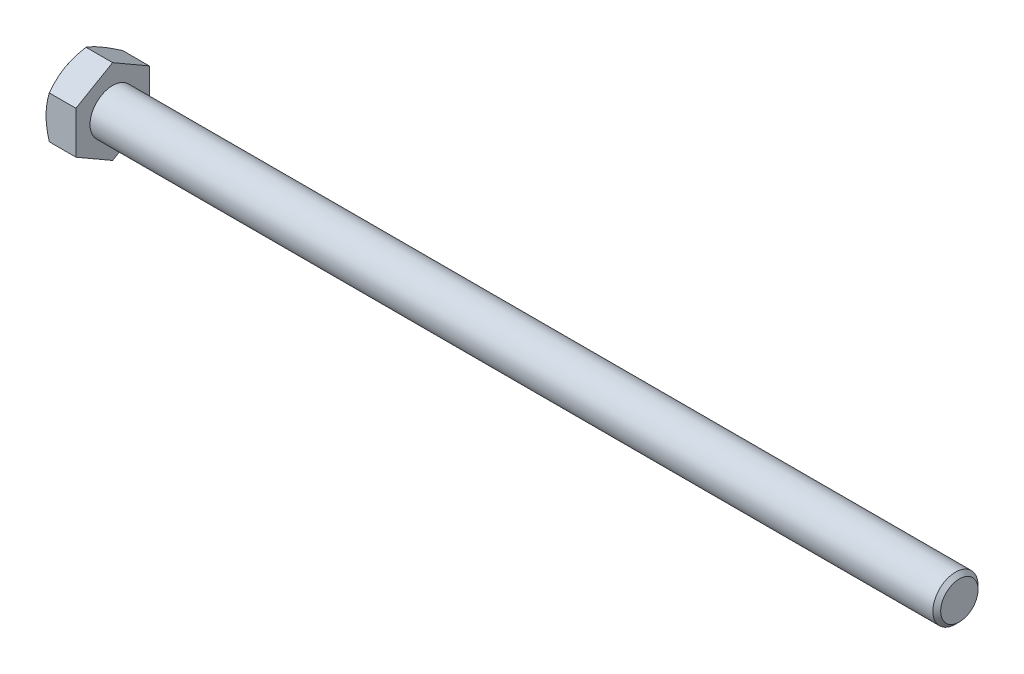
ISO-10303-21;
HEADER;
FILE_DESCRIPTION(('STEP AP214'),'2;1');
FILE_NAME('part.step','',(''),(''),'','','');
FILE_SCHEMA(('AUTOMOTIVE_DESIGN { 1 0 10303 214 1 1 1 1 }'));
ENDSEC;
DATA;
#1=APPLICATION_CONTEXT('core data for automotive mechanical design processes');
#2=APPLICATION_PROTOCOL_DEFINITION('international standard','automotive_design',2000,#1);
#3=PRODUCT_CONTEXT('',#1,'mechanical');
#4=PRODUCT('Part','Part','',(#3));
#5=PRODUCT_RELATED_PRODUCT_CATEGORY('part','',(#4));
#6=PRODUCT_DEFINITION_FORMATION('','',#4);
#7=PRODUCT_DEFINITION_CONTEXT('part definition',#1,'design');
#8=PRODUCT_DEFINITION('design','',#6,#7);
#9=PRODUCT_DEFINITION_SHAPE('','',#8);
#10=(LENGTH_UNIT() NAMED_UNIT(*) SI_UNIT(.MILLI.,.METRE.));
#11=(NAMED_UNIT(*) PLANE_ANGLE_UNIT() SI_UNIT($,.RADIAN.));
#12=(NAMED_UNIT(*) SI_UNIT($,.STERADIAN.) SOLID_ANGLE_UNIT());
#13=UNCERTAINTY_MEASURE_WITH_UNIT(LENGTH_MEASURE(1.E-05),#10,'distance_accuracy_value','');
#14=(GEOMETRIC_REPRESENTATION_CONTEXT(3) GLOBAL_UNCERTAINTY_ASSIGNED_CONTEXT((#13)) GLOBAL_UNIT_ASSIGNED_CONTEXT((#10,
#11,#12)) REPRESENTATION_CONTEXT('',''));
#15=CARTESIAN_POINT('',(0.,0.,0.));
#16=DIRECTION('',(0.,0.,1.));
#17=DIRECTION('',(1.,0.,0.));
#18=AXIS2_PLACEMENT_3D('',#15,#16,#17);
#19=CARTESIAN_POINT('',(5.3,3.75277674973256,-6.5));
#20=DIRECTION('',(0.,-0.866025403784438,0.500000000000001));
#21=DIRECTION('',(0.,-0.500000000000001,-0.866025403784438));
#22=AXIS2_PLACEMENT_3D('',#19,#20,#21);
#23=PLANE('',#22);
#24=CARTESIAN_POINT('',(0.580623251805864,7.50566896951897,0.0002));
#25=CARTESIAN_POINT('',(0.533004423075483,7.4231786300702,-0.14267745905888));
#26=CARTESIAN_POINT('',(0.487546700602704,7.34038072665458,-0.286087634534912));
#27=CARTESIAN_POINT('',(0.401548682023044,7.17411251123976,-0.574072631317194));
#28=CARTESIAN_POINT('',(0.361010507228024,7.09064192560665,-0.718647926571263));
#29=CARTESIAN_POINT('',(0.247571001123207,6.83889369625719,-1.15468865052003));
#30=CARTESIAN_POINT('',(0.183047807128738,6.66962231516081,-1.44787528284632));
#31=CARTESIAN_POINT('',(0.107386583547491,6.41631077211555,-1.88662374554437));
#32=CARTESIAN_POINT('',(0.0858328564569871,6.33302748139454,-2.03087463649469));
#33=CARTESIAN_POINT('',(0.0496903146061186,6.16608458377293,-2.32002821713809));
#34=CARTESIAN_POINT('',(0.0351008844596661,6.08242501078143,-2.46493084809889));
#35=CARTESIAN_POINT('',(0.0132587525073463,5.91496056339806,-2.75498777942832));
#36=CARTESIAN_POINT('',(0.00599772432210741,5.8311559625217,-2.90014160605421));
#37=CARTESIAN_POINT('',(-0.00103969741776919,5.66347396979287,-3.19057533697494));
#38=CARTESIAN_POINT('',(-0.000816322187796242,5.5795965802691,-3.33585523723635));
#39=CARTESIAN_POINT('',(0.0100834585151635,5.34979921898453,-3.73387594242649));
#40=CARTESIAN_POINT('',(0.0283818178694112,5.20395446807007,-3.98648646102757));
#41=CARTESIAN_POINT('',(0.0864063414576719,4.91323365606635,-4.49002967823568));
#42=CARTESIAN_POINT('',(0.126152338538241,4.76835861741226,-4.74096060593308));
#43=CARTESIAN_POINT('',(0.225505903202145,4.47705272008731,-5.24551722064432));
#44=CARTESIAN_POINT('',(0.285534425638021,4.33065861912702,-5.49907924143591));
#45=CARTESIAN_POINT('',(0.421774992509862,4.04005357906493,-6.00242193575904));
#46=CARTESIAN_POINT('',(0.497955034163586,3.89583891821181,-6.25220905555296));
#47=CARTESIAN_POINT('',(0.58062325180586,3.75266127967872,-6.5002));
#48=B_SPLINE_CURVE_WITH_KNOTS('',3,(#24,#25,#26,#27,#28,#29,#30,#31,#32,#33,#34,#35,#36,#37,#38,
#39,#40,#41,#42,#43,#44,#45,#46,#47),.UNSPECIFIED.,.F.,.F.,(4,2,2,2,2,2,2,2,2,2,2,4),(0.,
0.515105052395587,1.03043143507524,2.06322554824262,2.56697389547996,3.07067772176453,
3.57380860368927,4.0769239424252,4.9527935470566,5.82947446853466,6.72559912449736,
7.61996451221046),.UNSPECIFIED.);
#49=CARTESIAN_POINT('',(0.58055658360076,7.50555349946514,0.));
#50=VERTEX_POINT('',#49);
#51=CARTESIAN_POINT('',(0.,5.62916512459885,-3.25000000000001));
#52=VERTEX_POINT('',#51);
#53=EDGE_CURVE('E53',#50,#52,#48,.T.);
#54=ORIENTED_EDGE('',*,*,#53,.F.);
#55=DIRECTION('',(-1.,0.,0.));
#56=VECTOR('',#55,1.);
#57=CARTESIAN_POINT('',(5.3,7.50555349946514,0.));
#58=LINE('',#57,#56);
#59=CARTESIAN_POINT('',(5.3,7.50555349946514,0.));
#60=VERTEX_POINT('',#59);
#61=EDGE_CURVE('E157',#60,#50,#58,.T.);
#62=ORIENTED_EDGE('',*,*,#61,.F.);
#63=DIRECTION('',(0.,0.500000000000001,0.866025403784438));
#64=VECTOR('',#63,1.);
#65=CARTESIAN_POINT('',(5.3,3.75277674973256,-6.5));
#66=LINE('',#65,#64);
#67=CARTESIAN_POINT('',(5.3,3.75277674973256,-6.5));
#68=VERTEX_POINT('',#67);
#69=EDGE_CURVE('E263',#68,#60,#66,.T.);
#70=ORIENTED_EDGE('',*,*,#69,.F.);
#71=DIRECTION('',(-1.,0.,0.));
#72=VECTOR('',#71,1.);
#73=CARTESIAN_POINT('',(5.3,3.75277674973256,-6.5));
#74=LINE('',#73,#72);
#75=CARTESIAN_POINT('',(0.580556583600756,3.75277674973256,-6.5));
#76=VERTEX_POINT('',#75);
#77=EDGE_CURVE('E140',#68,#76,#74,.T.);
#78=ORIENTED_EDGE('',*,*,#77,.T.);
#79=EDGE_CURVE('E133',#52,#76,#48,.T.);
#80=ORIENTED_EDGE('',*,*,#79,.F.);
#81=EDGE_LOOP('',(#54,#62,#70,#78,#80));
#82=FACE_BOUND('',#81,.T.);
#83=ADVANCED_FACE('F36',(#82),#23,.F.);
#84=CARTESIAN_POINT('',(5.3,7.50555349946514,0.));
#85=DIRECTION('',(0.,-0.866025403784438,-0.500000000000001));
#86=DIRECTION('',(0.,0.500000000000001,-0.866025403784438));
#87=AXIS2_PLACEMENT_3D('',#84,#85,#86);
#88=PLANE('',#87);
#89=CARTESIAN_POINT('',(0.580623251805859,3.75266127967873,6.50019999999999));
#90=CARTESIAN_POINT('',(0.533004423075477,3.8351516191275,6.35732254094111));
#91=CARTESIAN_POINT('',(0.487546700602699,3.91794952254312,6.21391236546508));
#92=CARTESIAN_POINT('',(0.401548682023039,4.08421773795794,5.9259273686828));
#93=CARTESIAN_POINT('',(0.361010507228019,4.16768832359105,5.78135207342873));
#94=CARTESIAN_POINT('',(0.247571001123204,4.41943655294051,5.34531134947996));
#95=CARTESIAN_POINT('',(0.183047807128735,4.58870793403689,5.05212471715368));
#96=CARTESIAN_POINT('',(0.107386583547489,4.84201947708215,4.61337625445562));
#97=CARTESIAN_POINT('',(0.0858328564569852,4.92530276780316,4.46912536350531));
#98=CARTESIAN_POINT('',(0.0496903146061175,5.09224566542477,4.17997178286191));
#99=CARTESIAN_POINT('',(0.0351008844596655,5.17590523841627,4.03506915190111));
#100=CARTESIAN_POINT('',(0.0132587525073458,5.34336968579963,3.74501222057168));
#101=CARTESIAN_POINT('',(0.00599772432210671,5.427174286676,3.59985839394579));
#102=CARTESIAN_POINT('',(-0.00103969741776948,5.59485627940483,3.30942466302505));
#103=CARTESIAN_POINT('',(-0.000816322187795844,5.6787336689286,3.16414476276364));
#104=CARTESIAN_POINT('',(0.0100834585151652,5.90853103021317,2.76612405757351));
#105=CARTESIAN_POINT('',(0.028381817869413,6.05437578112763,2.51351353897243));
#106=CARTESIAN_POINT('',(0.0864063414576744,6.34509659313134,2.00997032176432));
#107=CARTESIAN_POINT('',(0.126152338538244,6.48997163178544,1.75903939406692));
#108=CARTESIAN_POINT('',(0.225505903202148,6.78127752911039,1.25448277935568));
#109=CARTESIAN_POINT('',(0.285534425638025,6.92767163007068,1.00092075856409));
#110=CARTESIAN_POINT('',(0.421774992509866,7.21827667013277,0.497578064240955));
#111=CARTESIAN_POINT('',(0.49795503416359,7.36249133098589,0.247790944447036));
#112=CARTESIAN_POINT('',(0.580623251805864,7.50566896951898,-0.000200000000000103));
#113=B_SPLINE_CURVE_WITH_KNOTS('',3,(#89,#90,#91,#92,#93,#94,#95,#96,#97,#98,#99,#100,#101,#102,
#103,#104,#105,#106,#107,#108,#109,#110,#111,#112),.UNSPECIFIED.,.F.,.F.,(4,2,2,2,2,2,2,2,2,2,2,
4),(0.,0.515105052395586,1.03043143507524,2.06322554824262,2.56697389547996,3.07067772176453,
3.57380860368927,4.07692394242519,4.95279354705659,5.82947446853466,6.72559912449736,
7.61996451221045),.UNSPECIFIED.);
#114=CARTESIAN_POINT('',(0.580556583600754,3.75277674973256,6.49999999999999));
#115=VERTEX_POINT('',#114);
#116=CARTESIAN_POINT('',(0.,5.62916512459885,3.25000000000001));
#117=VERTEX_POINT('',#116);
#118=EDGE_CURVE('E60',#115,#117,#113,.T.);
#119=ORIENTED_EDGE('',*,*,#118,.F.);
#120=DIRECTION('',(-1.,0.,0.));
#121=VECTOR('',#120,1.);
#122=CARTESIAN_POINT('',(5.3,3.75277674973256,6.49999999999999));
#123=LINE('',#122,#121);
#124=CARTESIAN_POINT('',(5.3,3.75277674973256,6.49999999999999));
#125=VERTEX_POINT('',#124);
#126=EDGE_CURVE('E154',#125,#115,#123,.T.);
#127=ORIENTED_EDGE('',*,*,#126,.F.);
#128=DIRECTION('',(0.,-0.500000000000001,0.866025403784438));
#129=VECTOR('',#128,1.);
#130=CARTESIAN_POINT('',(5.3,7.50555349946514,0.));
#131=LINE('',#130,#129);
#132=EDGE_CURVE('E261',#60,#125,#131,.T.);
#133=ORIENTED_EDGE('',*,*,#132,.F.);
#134=ORIENTED_EDGE('',*,*,#61,.T.);
#135=EDGE_CURVE('E181',#117,#50,#113,.T.);
#136=ORIENTED_EDGE('',*,*,#135,.F.);
#137=EDGE_LOOP('',(#119,#127,#133,#134,#136));
#138=FACE_BOUND('',#137,.T.);
#139=ADVANCED_FACE('F188',(#138),#88,.F.);
#140=CARTESIAN_POINT('',(5.3,3.75277674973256,6.49999999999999));
#141=DIRECTION('',(0.,0.,-1.));
#142=DIRECTION('',(0.,1.,0.));
#143=AXIS2_PLACEMENT_3D('',#140,#141,#142);
#144=PLANE('',#143);
#145=CARTESIAN_POINT('',(3.18835311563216,-10.1137456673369,6.50000000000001));
#146=CARTESIAN_POINT('',(3.05034773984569,-9.82952666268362,6.50000000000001));
#147=CARTESIAN_POINT('',(2.91365616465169,-9.5446586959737,6.5));
#148=CARTESIAN_POINT('',(2.64363899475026,-8.97327978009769,6.5));
#149=CARTESIAN_POINT('',(2.51031392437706,-8.68676858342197,6.5));
#150=CARTESIAN_POINT('',(2.24710473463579,-8.110298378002,6.5));
#151=CARTESIAN_POINT('',(2.11724300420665,-7.82032911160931,6.5));
#152=CARTESIAN_POINT('',(1.86279082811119,-7.23809540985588,6.5));
#153=CARTESIAN_POINT('',(1.73820013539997,-6.94583108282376,6.5));
#154=CARTESIAN_POINT('',(1.49176685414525,-6.34906440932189,6.5));
#155=CARTESIAN_POINT('',(1.37014257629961,-6.0444714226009,6.5));
#156=CARTESIAN_POINT('',(1.13601865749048,-5.43173420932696,6.5));
#157=CARTESIAN_POINT('',(1.02352003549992,-5.12358959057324,6.5));
#158=CARTESIAN_POINT('',(0.810575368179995,-4.50382569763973,6.5));
#159=CARTESIAN_POINT('',(0.710105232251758,-4.19221478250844,6.5));
#160=CARTESIAN_POINT('',(0.524420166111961,-3.56452019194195,6.5));
#161=CARTESIAN_POINT('',(0.439200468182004,-3.248437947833,6.5));
#162=CARTESIAN_POINT('',(0.288524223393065,-2.61335465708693,6.5));
#163=CARTESIAN_POINT('',(0.222961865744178,-2.29437912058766,6.5));
#164=CARTESIAN_POINT('',(0.115312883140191,-1.65238219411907,6.5));
#165=CARTESIAN_POINT('',(0.0732239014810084,-1.32936121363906,6.5));
#166=CARTESIAN_POINT('',(0.0304887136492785,-0.845231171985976,6.5));
#167=CARTESIAN_POINT('',(0.0196493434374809,-0.684982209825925,6.5));
#168=CARTESIAN_POINT('',(0.00475298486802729,-0.364162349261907,6.5));
#169=CARTESIAN_POINT('',(0.000695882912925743,-0.20359145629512,6.5));
#170=CARTESIAN_POINT('',(-0.000531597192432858,0.117577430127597,6.5));
#171=CARTESIAN_POINT('',(0.00229809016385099,0.278175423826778,6.5));
#172=CARTESIAN_POINT('',(0.0147726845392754,0.599108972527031,6.5));
#173=CARTESIAN_POINT('',(0.0244179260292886,0.759444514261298,6.5));
#174=CARTESIAN_POINT('',(0.055496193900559,1.14369946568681,6.5));
#175=CARTESIAN_POINT('',(0.0801030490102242,1.36736763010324,6.5));
#176=CARTESIAN_POINT('',(0.141246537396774,1.81305591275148,6.5));
#177=CARTESIAN_POINT('',(0.177784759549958,2.035075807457,6.49999999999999));
#178=CARTESIAN_POINT('',(0.303360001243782,2.69839633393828,6.49999999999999));
#179=CARTESIAN_POINT('',(0.408335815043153,3.13672010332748,6.49999999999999));
#180=CARTESIAN_POINT('',(0.590564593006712,3.79232112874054,6.49999999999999));
#181=CARTESIAN_POINT('',(0.656313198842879,4.01299150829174,6.49999999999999));
#182=CARTESIAN_POINT('',(0.794681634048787,4.4521885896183,6.49999999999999));
#183=CARTESIAN_POINT('',(0.867301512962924,4.67071527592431,6.49999999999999));
#184=CARTESIAN_POINT('',(1.01824353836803,5.10569490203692,6.49999999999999));
#185=CARTESIAN_POINT('',(1.09656388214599,5.32214847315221,6.49999999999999));
#186=CARTESIAN_POINT('',(1.25798086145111,5.75325725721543,6.49999999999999));
#187=CARTESIAN_POINT('',(1.34107741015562,5.96791250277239,6.49999999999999));
#188=CARTESIAN_POINT('',(1.56029019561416,6.51888445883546,6.49999999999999));
#189=CARTESIAN_POINT('',(1.69936356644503,6.85402316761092,6.49999999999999));
#190=CARTESIAN_POINT('',(1.98501958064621,7.52109583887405,6.49999999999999));
#191=CARTESIAN_POINT('',(2.13160288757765,7.853029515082,6.49999999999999));
#192=CARTESIAN_POINT('',(2.43059748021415,8.51437865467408,6.49999999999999));
#193=CARTESIAN_POINT('',(2.58301057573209,8.84379329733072,6.49999999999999));
#194=CARTESIAN_POINT('',(2.89234869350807,9.50047798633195,6.49999999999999));
#195=CARTESIAN_POINT('',(3.04927357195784,9.82774810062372,6.49999999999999));
#196=CARTESIAN_POINT('',(3.366920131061,10.4809971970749,6.49999999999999));
#197=CARTESIAN_POINT('',(3.5276467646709,10.8069737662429,6.49999999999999));
#198=CARTESIAN_POINT('',(3.85198555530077,11.4574882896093,6.49999999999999));
#199=CARTESIAN_POINT('',(4.0155977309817,11.7820262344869,6.49999999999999));
#200=CARTESIAN_POINT('',(4.50986184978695,12.753746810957,6.49999999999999));
#201=CARTESIAN_POINT('',(4.8439999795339,13.3991555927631,6.49999999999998));
#202=CARTESIAN_POINT('',(5.48575990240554,14.6239779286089,6.49999999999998));
#203=CARTESIAN_POINT('',(5.79279643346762,15.20369957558,6.49999999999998));
#204=CARTESIAN_POINT('',(6.41069188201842,16.3611382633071,6.49999999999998));
#205=CARTESIAN_POINT('',(6.72155098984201,16.9388552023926,6.49999999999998));
#206=CARTESIAN_POINT('',(7.34519775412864,18.0910273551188,6.49999999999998));
#207=CARTESIAN_POINT('',(7.65797694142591,18.6654871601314,6.49999999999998));
#208=CARTESIAN_POINT('',(8.28574397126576,19.8131486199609,6.49999999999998));
#209=CARTESIAN_POINT('',(8.60073166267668,20.3863503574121,6.49999999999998));
#210=CARTESIAN_POINT('',(8.91652967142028,20.9591024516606,6.49999999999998));
#211=B_SPLINE_CURVE_WITH_KNOTS('',3,(#145,#146,#147,#148,#149,#150,#151,#152,#153,#154,#155,
#156,#157,#158,#159,#160,#161,#162,#163,#164,#165,#166,#167,#168,#169,#170,#171,#172,#173,#174,
#175,#176,#177,#178,#179,#180,#181,#182,#183,#184,#185,#186,#187,#188,#189,#190,#191,#192,#193,
#194,#195,#196,#197,#198,#199,#200,#201,#202,#203,#204,#205,#206,#207,#208,#209,#210),
.UNSPECIFIED.,.F.,.F.,(4,2,2,2,2,2,2,2,2,2,2,2,2,2,2,2,2,2,2,2,2,2,2,2,2,2,2,2,2,2,2,2,4),(0.,
0.947868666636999,1.89588406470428,2.84900320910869,3.80207763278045,4.7858977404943,
5.76982755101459,6.75175256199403,7.73337005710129,8.70960474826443,9.68574140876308,
10.1674651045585,10.6491807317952,11.1309009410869,11.6126447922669,12.2873175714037,
12.9620802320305,14.3123184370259,15.0030310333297,15.6937486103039,16.3842486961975,
17.074736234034,18.1631508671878,19.2516618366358,20.3405135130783,21.4293305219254,
22.519654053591,23.6099846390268,25.7902468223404,27.7582608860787,29.7263733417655,
31.6886408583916,33.6507753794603),.UNSPECIFIED.);
#212=CARTESIAN_POINT('',(0.580556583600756,-3.75277674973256,6.5));
#213=VERTEX_POINT('',#212);
#214=CARTESIAN_POINT('',(0.,0.,6.5));
#215=VERTEX_POINT('',#214);
#216=EDGE_CURVE('E274',#213,#215,#211,.T.);
#217=ORIENTED_EDGE('',*,*,#216,.F.);
#218=DIRECTION('',(-1.,0.,0.));
#219=VECTOR('',#218,1.);
#220=CARTESIAN_POINT('',(5.3,-3.75277674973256,6.5));
#221=LINE('',#220,#219);
#222=CARTESIAN_POINT('',(5.3,-3.75277674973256,6.5));
#223=VERTEX_POINT('',#222);
#224=EDGE_CURVE('E145',#223,#213,#221,.T.);
#225=ORIENTED_EDGE('',*,*,#224,.F.);
#226=DIRECTION('',(0.,-1.,0.));
#227=VECTOR('',#226,1.);
#228=CARTESIAN_POINT('',(5.3,3.75277674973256,6.49999999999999));
#229=LINE('',#228,#227);
#230=EDGE_CURVE('E256',#125,#223,#229,.T.);
#231=ORIENTED_EDGE('',*,*,#230,.F.);
#232=ORIENTED_EDGE('',*,*,#126,.T.);
#233=EDGE_CURVE('E206',#215,#115,#211,.T.);
#234=ORIENTED_EDGE('',*,*,#233,.F.);
#235=EDGE_LOOP('',(#217,#225,#231,#232,#234));
#236=FACE_BOUND('',#235,.T.);
#237=ADVANCED_FACE('F282',(#236),#144,.F.);
#238=CARTESIAN_POINT('',(5.3,-7.50555349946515,0.));
#239=DIRECTION('',(0.,0.866025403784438,-0.500000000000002));
#240=DIRECTION('',(0.,0.500000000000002,0.866025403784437));
#241=AXIS2_PLACEMENT_3D('',#238,#239,#240);
#242=PLANE('',#241);
#243=CARTESIAN_POINT('',(0.58062325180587,-7.50566896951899,-0.000200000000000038));
#244=CARTESIAN_POINT('',(0.533004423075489,-7.42317863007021,0.14267745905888));
#245=CARTESIAN_POINT('',(0.487546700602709,-7.34038072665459,0.286087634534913));
#246=CARTESIAN_POINT('',(0.401548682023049,-7.17411251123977,0.574072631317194));
#247=CARTESIAN_POINT('',(0.361010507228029,-7.09064192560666,0.718647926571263));
#248=CARTESIAN_POINT('',(0.247571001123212,-6.8388936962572,1.15468865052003));
#249=CARTESIAN_POINT('',(0.183047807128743,-6.66962231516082,1.44787528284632));
#250=CARTESIAN_POINT('',(0.107386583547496,-6.41631077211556,1.88662374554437));
#251=CARTESIAN_POINT('',(0.0858328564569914,-6.33302748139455,2.03087463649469));
#252=CARTESIAN_POINT('',(0.0496903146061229,-6.16608458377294,2.32002821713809));
#253=CARTESIAN_POINT('',(0.0351008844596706,-6.08242501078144,2.46493084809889));
#254=CARTESIAN_POINT('',(0.0132587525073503,-5.91496056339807,2.75498777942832));
#255=CARTESIAN_POINT('',(0.00599772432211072,-5.83115596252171,2.90014160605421));
#256=CARTESIAN_POINT('',(-0.00103969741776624,-5.66347396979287,3.19057533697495));
#257=CARTESIAN_POINT('',(-0.000816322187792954,-5.57959658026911,3.33585523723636));
#258=CARTESIAN_POINT('',(0.0100834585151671,-5.34979921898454,3.73387594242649));
#259=CARTESIAN_POINT('',(0.028381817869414,-5.20395446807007,3.98648646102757));
#260=CARTESIAN_POINT('',(0.0864063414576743,-4.91323365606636,4.49002967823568));
#261=CARTESIAN_POINT('',(0.126152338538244,-4.76835861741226,4.74096060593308));
#262=CARTESIAN_POINT('',(0.225505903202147,-4.47705272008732,5.24551722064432));
#263=CARTESIAN_POINT('',(0.285534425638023,-4.33065861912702,5.49907924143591));
#264=CARTESIAN_POINT('',(0.421774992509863,-4.04005357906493,6.00242193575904));
#265=CARTESIAN_POINT('',(0.497955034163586,-3.89583891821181,6.25220905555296));
#266=CARTESIAN_POINT('',(0.58062325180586,-3.75266127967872,6.5002));
#267=B_SPLINE_CURVE_WITH_KNOTS('',3,(#243,#244,#245,#246,#247,#248,#249,#250,#251,#252,#253,
#254,#255,#256,#257,#258,#259,#260,#261,#262,#263,#264,#265,#266),.UNSPECIFIED.,.F.,.F.,(4,2,2,
2,2,2,2,2,2,2,2,4),(0.,0.515105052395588,1.03043143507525,2.06322554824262,2.56697389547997,
3.07067772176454,3.57380860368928,4.0769239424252,4.9527935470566,5.82947446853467,
6.72559912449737,7.61996451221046),.UNSPECIFIED.);
#268=CARTESIAN_POINT('',(0.580556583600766,-7.50555349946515,0.));
#269=VERTEX_POINT('',#268);
#270=CARTESIAN_POINT('',(0.,-5.62916512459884,3.25000000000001));
#271=VERTEX_POINT('',#270);
#272=EDGE_CURVE('E190',#269,#271,#267,.T.);
#273=ORIENTED_EDGE('',*,*,#272,.F.);
#274=DIRECTION('',(-1.,0.,0.));
#275=VECTOR('',#274,1.);
#276=CARTESIAN_POINT('',(5.3,-7.50555349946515,0.));
#277=LINE('',#276,#275);
#278=CARTESIAN_POINT('',(5.3,-7.50555349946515,0.));
#279=VERTEX_POINT('',#278);
#280=EDGE_CURVE('E139',#279,#269,#277,.T.);
#281=ORIENTED_EDGE('',*,*,#280,.F.);
#282=DIRECTION('',(0.,-0.500000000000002,-0.866025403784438));
#283=VECTOR('',#282,1.);
#284=CARTESIAN_POINT('',(5.3,-7.50555349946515,0.));
#285=LINE('',#284,#283);
#286=EDGE_CURVE('E253',#223,#279,#285,.T.);
#287=ORIENTED_EDGE('',*,*,#286,.F.);
#288=ORIENTED_EDGE('',*,*,#224,.T.);
#289=EDGE_CURVE('E193',#271,#213,#267,.T.);
#290=ORIENTED_EDGE('',*,*,#289,.F.);
#291=EDGE_LOOP('',(#273,#281,#287,#288,#290));
#292=FACE_BOUND('',#291,.T.);
#293=ADVANCED_FACE('F248',(#292),#242,.F.);
#294=CARTESIAN_POINT('',(5.3,-3.75277674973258,-6.5));
#295=DIRECTION('',(0.,0.866025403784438,0.5));
#296=DIRECTION('',(0.,-0.5,0.866025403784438));
#297=AXIS2_PLACEMENT_3D('',#294,#295,#296);
#298=PLANE('',#297);
#299=CARTESIAN_POINT('',(0.580623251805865,-3.75266127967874,-6.5002));
#300=CARTESIAN_POINT('',(0.533004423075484,-3.83515161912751,-6.35732254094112));
#301=CARTESIAN_POINT('',(0.487546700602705,-3.91794952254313,-6.21391236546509));
#302=CARTESIAN_POINT('',(0.401548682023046,-4.08421773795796,-5.9259273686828));
#303=CARTESIAN_POINT('',(0.361010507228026,-4.16768832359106,-5.78135207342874));
#304=CARTESIAN_POINT('',(0.24757100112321,-4.41943655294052,-5.34531134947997));
#305=CARTESIAN_POINT('',(0.183047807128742,-4.58870793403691,-5.05212471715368));
#306=CARTESIAN_POINT('',(0.107386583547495,-4.84201947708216,-4.61337625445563));
#307=CARTESIAN_POINT('',(0.0858328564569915,-4.92530276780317,-4.46912536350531));
#308=CARTESIAN_POINT('',(0.0496903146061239,-5.09224566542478,-4.17997178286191));
#309=CARTESIAN_POINT('',(0.0351008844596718,-5.17590523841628,-4.03506915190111));
#310=CARTESIAN_POINT('',(0.0132587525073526,-5.34336968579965,-3.74501222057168));
#311=CARTESIAN_POINT('',(0.00599772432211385,-5.42717428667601,-3.59985839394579));
#312=CARTESIAN_POINT('',(-0.00103969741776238,-5.59485627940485,-3.30942466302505));
#313=CARTESIAN_POINT('',(-0.000816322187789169,-5.67873366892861,-3.16414476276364));
#314=CARTESIAN_POINT('',(0.0100834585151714,-5.90853103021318,-2.76612405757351));
#315=CARTESIAN_POINT('',(0.0283818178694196,-6.05437578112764,-2.51351353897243));
#316=CARTESIAN_POINT('',(0.0864063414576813,-6.34509659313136,-2.00997032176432));
#317=CARTESIAN_POINT('',(0.126152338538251,-6.48997163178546,-1.75903939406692));
#318=CARTESIAN_POINT('',(0.225505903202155,-6.7812775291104,-1.25448277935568));
#319=CARTESIAN_POINT('',(0.285534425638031,-6.92767163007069,-1.00092075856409));
#320=CARTESIAN_POINT('',(0.421774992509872,-7.21827667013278,-0.497578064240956));
#321=CARTESIAN_POINT('',(0.497955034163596,-7.3624913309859,-0.247790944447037));
#322=CARTESIAN_POINT('',(0.58062325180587,-7.50566896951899,0.000199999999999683));
#323=B_SPLINE_CURVE_WITH_KNOTS('',3,(#299,#300,#301,#302,#303,#304,#305,#306,#307,#308,#309,
#310,#311,#312,#313,#314,#315,#316,#317,#318,#319,#320,#321,#322),.UNSPECIFIED.,.F.,.F.,(4,2,2,
2,2,2,2,2,2,2,2,4),(0.,0.515105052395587,1.03043143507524,2.06322554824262,2.56697389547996,
3.07067772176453,3.57380860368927,4.0769239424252,4.9527935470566,5.82947446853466,
6.72559912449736,7.61996451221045),.UNSPECIFIED.);
#324=CARTESIAN_POINT('',(0.580556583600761,-3.75277674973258,-6.5));
#325=VERTEX_POINT('',#324);
#326=CARTESIAN_POINT('',(0.,-5.62916512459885,-3.25));
#327=VERTEX_POINT('',#326);
#328=EDGE_CURVE('E113',#325,#327,#323,.T.);
#329=ORIENTED_EDGE('',*,*,#328,.F.);
#330=DIRECTION('',(-1.,0.,0.));
#331=VECTOR('',#330,1.);
#332=CARTESIAN_POINT('',(5.3,-3.75277674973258,-6.5));
#333=LINE('',#332,#331);
#334=CARTESIAN_POINT('',(5.3,-3.75277674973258,-6.5));
#335=VERTEX_POINT('',#334);
#336=EDGE_CURVE('E128',#335,#325,#333,.T.);
#337=ORIENTED_EDGE('',*,*,#336,.F.);
#338=DIRECTION('',(0.,0.5,-0.866025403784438));
#339=VECTOR('',#338,1.);
#340=CARTESIAN_POINT('',(5.3,-3.75277674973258,-6.5));
#341=LINE('',#340,#339);
#342=EDGE_CURVE('E250',#279,#335,#341,.T.);
#343=ORIENTED_EDGE('',*,*,#342,.F.);
#344=ORIENTED_EDGE('',*,*,#280,.T.);
#345=EDGE_CURVE('E131',#327,#269,#323,.T.);
#346=ORIENTED_EDGE('',*,*,#345,.F.);
#347=EDGE_LOOP('',(#329,#337,#343,#344,#346));
#348=FACE_BOUND('',#347,.T.);
#349=ADVANCED_FACE('F126',(#348),#298,.F.);
#350=CARTESIAN_POINT('',(5.3,3.75277674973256,-6.5));
#351=DIRECTION('',(0.,0.,1.));
#352=DIRECTION('',(0.,-1.,0.));
#353=AXIS2_PLACEMENT_3D('',#350,#351,#352);
#354=PLANE('',#353);
#355=CARTESIAN_POINT('',(3.18835311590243,-10.1137456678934,-6.5));
#356=CARTESIAN_POINT('',(3.05034774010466,-9.82952666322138,-6.5));
#357=CARTESIAN_POINT('',(2.91365616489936,-9.54465869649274,-6.5));
#358=CARTESIAN_POINT('',(2.64363899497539,-8.97327978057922,-6.5));
#359=CARTESIAN_POINT('',(2.51031392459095,-8.68676858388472,-6.5));
#360=CARTESIAN_POINT('',(2.24710473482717,-8.11029837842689,-6.5));
#361=CARTESIAN_POINT('',(2.11724300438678,-7.82032911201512,-6.5));
#362=CARTESIAN_POINT('',(1.86279082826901,-7.2380954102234,-6.5));
#363=CARTESIAN_POINT('',(1.73820013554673,-6.94583108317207,-6.5));
#364=CARTESIAN_POINT('',(1.4917668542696,-6.34906440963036,-6.5));
#365=CARTESIAN_POINT('',(1.37014257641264,-6.04447142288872,-6.5));
#366=CARTESIAN_POINT('',(1.13601865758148,-5.43173420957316,-6.5));
#367=CARTESIAN_POINT('',(1.02352003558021,-5.12358959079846,-6.5));
#368=CARTESIAN_POINT('',(0.810575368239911,-4.5038256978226,-6.5));
#369=CARTESIAN_POINT('',(0.710105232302,-4.19221478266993,-6.5));
#370=CARTESIAN_POINT('',(0.52442016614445,-3.56452019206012,-6.5));
#371=CARTESIAN_POINT('',(0.439200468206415,-3.24843794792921,-6.5));
#372=CARTESIAN_POINT('',(0.288524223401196,-2.61335465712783,-6.5));
#373=CARTESIAN_POINT('',(0.222961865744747,-2.29437912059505,-6.5));
#374=CARTESIAN_POINT('',(0.115312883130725,-1.65238219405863,-6.5));
#375=CARTESIAN_POINT('',(0.0732239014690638,-1.3293612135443,-6.5));
#376=CARTESIAN_POINT('',(0.030488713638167,-0.845231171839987,-6.5));
#377=CARTESIAN_POINT('',(0.0196493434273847,-0.684982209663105,-6.5));
#378=CARTESIAN_POINT('',(0.00475298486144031,-0.364162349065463,-6.5));
#379=CARTESIAN_POINT('',(0.000695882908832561,-0.203591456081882,-6.5));
#380=CARTESIAN_POINT('',(-0.000531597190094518,0.117577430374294,-6.5));
#381=CARTESIAN_POINT('',(0.00229809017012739,0.27817542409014,-6.5));
#382=CARTESIAN_POINT('',(0.0147726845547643,0.599108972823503,-6.5));
#383=CARTESIAN_POINT('',(0.0244179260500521,0.759444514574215,-6.5));
#384=CARTESIAN_POINT('',(0.0554961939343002,1.14369946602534,-6.5));
#385=CARTESIAN_POINT('',(0.0801030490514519,1.36736763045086,-6.5));
#386=CARTESIAN_POINT('',(0.141246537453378,1.81305591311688,-6.5));
#387=CARTESIAN_POINT('',(0.177784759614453,2.03507580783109,-6.5));
#388=CARTESIAN_POINT('',(0.303360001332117,2.69839633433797,-6.5));
#389=CARTESIAN_POINT('',(0.408335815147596,3.13672010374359,-6.5));
#390=CARTESIAN_POINT('',(0.590564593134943,3.79232112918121,-6.5));
#391=CARTESIAN_POINT('',(0.656313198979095,4.01299150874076,-6.5));
#392=CARTESIAN_POINT('',(0.794681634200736,4.45218859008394,-6.5));
#393=CARTESIAN_POINT('',(0.867301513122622,4.67071527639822,-6.5));
#394=CARTESIAN_POINT('',(1.01824353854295,5.1056949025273,-6.5));
#395=CARTESIAN_POINT('',(1.09656388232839,5.32214847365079,-6.5));
#396=CARTESIAN_POINT('',(1.25798086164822,5.75325725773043,-6.5));
#397=CARTESIAN_POINT('',(1.34107741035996,5.96791250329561,-6.5));
#398=CARTESIAN_POINT('',(1.56029019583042,6.51888445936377,-6.5));
#399=CARTESIAN_POINT('',(1.69936356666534,6.85402316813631,-6.5));
#400=CARTESIAN_POINT('',(1.98501958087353,7.52109583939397,-6.5));
#401=CARTESIAN_POINT('',(2.13160288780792,7.85302951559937,-6.5));
#402=CARTESIAN_POINT('',(2.43059748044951,8.51437865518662,-6.5));
#403=CARTESIAN_POINT('',(2.58301057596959,8.84379329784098,-6.5));
#404=CARTESIAN_POINT('',(2.89234869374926,9.50047798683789,-6.5));
#405=CARTESIAN_POINT('',(3.04927357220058,9.82774810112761,-6.5));
#406=CARTESIAN_POINT('',(3.36692013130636,10.4809971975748,-6.5));
#407=CARTESIAN_POINT('',(3.52764676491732,10.8069737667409,-6.5));
#408=CARTESIAN_POINT('',(3.85198555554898,11.4574882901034,-6.5));
#409=CARTESIAN_POINT('',(4.01559773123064,11.7820262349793,-6.5));
#410=CARTESIAN_POINT('',(4.50986185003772,12.7537468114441,-6.5));
#411=CARTESIAN_POINT('',(4.84399997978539,13.3991555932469,-6.5));
#412=CARTESIAN_POINT('',(5.48575990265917,14.6239779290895,-6.5));
#413=CARTESIAN_POINT('',(5.79279643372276,15.2036995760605,-6.5));
#414=CARTESIAN_POINT('',(6.41069188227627,16.3611382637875,-6.5));
#415=CARTESIAN_POINT('',(6.72155099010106,16.9388552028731,-6.5));
#416=CARTESIAN_POINT('',(7.34519775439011,18.0910273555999,-6.5));
#417=CARTESIAN_POINT('',(7.6579769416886,18.6654871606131,-6.5));
#418=CARTESIAN_POINT('',(8.28574397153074,19.8131486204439,-6.5));
#419=CARTESIAN_POINT('',(8.60073166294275,20.3863503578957,-6.5));
#420=CARTESIAN_POINT('',(8.91652967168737,20.9591024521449,-6.5));
#421=B_SPLINE_CURVE_WITH_KNOTS('',3,(#355,#356,#357,#358,#359,#360,#361,#362,#363,#364,#365,
#366,#367,#368,#369,#370,#371,#372,#373,#374,#375,#376,#377,#378,#379,#380,#381,#382,#383,#384,
#385,#386,#387,#388,#389,#390,#391,#392,#393,#394,#395,#396,#397,#398,#399,#400,#401,#402,#403,
#404,#405,#406,#407,#408,#409,#410,#411,#412,#413,#414,#415,#416,#417,#418,#419,#420),
.UNSPECIFIED.,.F.,.F.,(4,2,2,2,2,2,2,2,2,2,2,2,2,2,2,2,2,2,2,2,2,2,2,2,2,2,2,2,2,2,2,2,4),(0.,
0.947868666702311,1.89588406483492,2.84900320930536,3.80207763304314,4.7858977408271,
5.76982755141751,6.75175256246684,7.73337005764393,8.7096047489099,9.68574140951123,
10.1674651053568,10.6491807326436,11.1309009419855,11.6126447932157,12.287317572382,
12.9620802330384,14.312318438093,15.0030310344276,15.6937486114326,16.3842486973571,
17.0747362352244,18.1631508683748,19.2516618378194,20.3405135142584,21.429330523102,
22.5196540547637,23.6099846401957,25.7902468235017,27.7582608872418,29.7263733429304,
31.6886408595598,33.6507753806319),.UNSPECIFIED.);
#422=CARTESIAN_POINT('',(0.,0.,-6.5));
#423=VERTEX_POINT('',#422);
#424=EDGE_CURVE('E120',#76,#423,#421,.F.);
#425=ORIENTED_EDGE('',*,*,#424,.F.);
#426=ORIENTED_EDGE('',*,*,#77,.F.);
#427=DIRECTION('',(0.,1.,0.));
#428=VECTOR('',#427,1.);
#429=CARTESIAN_POINT('',(5.3,3.75277674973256,-6.5));
#430=LINE('',#429,#428);
#431=EDGE_CURVE('E137',#335,#68,#430,.T.);
#432=ORIENTED_EDGE('',*,*,#431,.F.);
#433=ORIENTED_EDGE('',*,*,#336,.T.);
#434=EDGE_CURVE('E110',#423,#325,#421,.F.);
#435=ORIENTED_EDGE('',*,*,#434,.F.);
#436=EDGE_LOOP('',(#425,#426,#432,#433,#435));
#437=FACE_BOUND('',#436,.T.);
#438=ADVANCED_FACE('F135',(#437),#354,.F.);
#439=CARTESIAN_POINT('',(5.3,7.50555349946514,0.));
#440=DIRECTION('',(1.,0.,0.));
#441=DIRECTION('',(0.,0.,-1.));
#442=AXIS2_PLACEMENT_3D('',#439,#440,#441);
#443=PLANE('',#442);
#444=ORIENTED_EDGE('',*,*,#69,.T.);
#445=ORIENTED_EDGE('',*,*,#132,.T.);
#446=ORIENTED_EDGE('',*,*,#230,.T.);
#447=ORIENTED_EDGE('',*,*,#286,.T.);
#448=ORIENTED_EDGE('',*,*,#342,.T.);
#449=ORIENTED_EDGE('',*,*,#431,.T.);
#450=EDGE_LOOP('',(#444,#445,#446,#447,#448,#449));
#451=FACE_BOUND('',#450,.T.);
#452=CARTESIAN_POINT('',(5.3,0.,0.));
#453=DIRECTION('',(1.,0.,0.));
#454=DIRECTION('',(0.,0.,-1.));
#455=AXIS2_PLACEMENT_3D('',#452,#453,#454);
#456=CIRCLE('',#455,4.);
#457=CARTESIAN_POINT('',(5.3,0.,-4.));
#458=VERTEX_POINT('',#457);
#459=EDGE_CURVE('E267',#458,#458,#456,.F.);
#460=ORIENTED_EDGE('',*,*,#459,.T.);
#461=EDGE_LOOP('',(#460));
#462=FACE_BOUND('',#461,.T.);
#463=ADVANCED_FACE('F284',(#451,#462),#443,.T.);
#464=CARTESIAN_POINT('',(0.,0.,0.));
#465=DIRECTION('',(-1.,0.,0.));
#466=DIRECTION('',(0.,0.,1.));
#467=AXIS2_PLACEMENT_3D('',#464,#465,#466);
#468=CYLINDRICAL_SURFACE('',#467,4.);
#469=ORIENTED_EDGE('',*,*,#459,.F.);
#470=EDGE_LOOP('',(#469));
#471=FACE_BOUND('',#470,.T.);
#472=CARTESIAN_POINT('',(154.6095,0.,0.));
#473=DIRECTION('',(-1.,0.,0.));
#474=DIRECTION('',(0.,0.,1.));
#475=AXIS2_PLACEMENT_3D('',#472,#473,#474);
#476=CIRCLE('',#475,4.);
#477=CARTESIAN_POINT('',(154.6095,0.,4.));
#478=VERTEX_POINT('',#477);
#479=EDGE_CURVE('E270',#478,#478,#476,.T.);
#480=ORIENTED_EDGE('',*,*,#479,.T.);
#481=EDGE_LOOP('',(#480));
#482=FACE_BOUND('',#481,.T.);
#483=ADVANCED_FACE('F316',(#471,#482),#468,.T.);
#484=CARTESIAN_POINT('',(155.3,0.,0.));
#485=DIRECTION('',(-1.,0.,0.));
#486=DIRECTION('',(0.,0.,1.));
#487=AXIS2_PLACEMENT_3D('',#484,#485,#486);
#488=CONICAL_SURFACE('',#487,3.3095,0.785398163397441);
#489=ORIENTED_EDGE('',*,*,#479,.F.);
#490=EDGE_LOOP('',(#489));
#491=FACE_BOUND('',#490,.T.);
#492=CARTESIAN_POINT('',(155.3,0.,0.));
#493=DIRECTION('',(-1.,0.,0.));
#494=DIRECTION('',(0.,0.,1.));
#495=AXIS2_PLACEMENT_3D('',#492,#493,#494);
#496=CIRCLE('',#495,3.3095);
#497=CARTESIAN_POINT('',(155.3,0.,3.3095));
#498=VERTEX_POINT('',#497);
#499=EDGE_CURVE('E272',#498,#498,#496,.T.);
#500=ORIENTED_EDGE('',*,*,#499,.T.);
#501=EDGE_LOOP('',(#500));
#502=FACE_BOUND('',#501,.T.);
#503=ADVANCED_FACE('F318',(#491,#502),#488,.T.);
#504=CARTESIAN_POINT('',(155.3,0.,0.));
#505=DIRECTION('',(-1.,0.,0.));
#506=DIRECTION('',(0.,0.,1.));
#507=AXIS2_PLACEMENT_3D('',#504,#505,#506);
#508=PLANE('',#507);
#509=ORIENTED_EDGE('',*,*,#499,.F.);
#510=EDGE_LOOP('',(#509));
#511=FACE_BOUND('',#510,.T.);
#512=ADVANCED_FACE('F219',(#511),#508,.F.);
#513=CARTESIAN_POINT('',(0.,0.,0.));
#514=DIRECTION('',(1.,0.,0.));
#515=DIRECTION('',(0.,0.,-1.));
#516=AXIS2_PLACEMENT_3D('',#513,#514,#515);
#517=CONICAL_SURFACE('',#516,6.5,1.0471975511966);
#518=ORIENTED_EDGE('',*,*,#328,.T.);
#519=CARTESIAN_POINT('',(0.,0.,0.));
#520=DIRECTION('',(1.,0.,0.));
#521=DIRECTION('',(0.,0.,-1.));
#522=AXIS2_PLACEMENT_3D('',#519,#520,#521);
#523=CIRCLE('',#522,6.5);
#524=EDGE_CURVE('E40',#327,#423,#523,.T.);
#525=ORIENTED_EDGE('',*,*,#524,.T.);
#526=ORIENTED_EDGE('',*,*,#434,.T.);
#527=EDGE_LOOP('',(#518,#525,#526));
#528=FACE_BOUND('',#527,.T.);
#529=ADVANCED_FACE('F112',(#528),#517,.T.);
#530=ORIENTED_EDGE('',*,*,#272,.T.);
#531=EDGE_CURVE('E166',#271,#327,#523,.T.);
#532=ORIENTED_EDGE('',*,*,#531,.T.);
#533=ORIENTED_EDGE('',*,*,#345,.T.);
#534=EDGE_LOOP('',(#530,#532,#533));
#535=FACE_BOUND('',#534,.T.);
#536=ADVANCED_FACE('F218',(#535),#517,.T.);
#537=ORIENTED_EDGE('',*,*,#216,.T.);
#538=EDGE_CURVE('E169',#215,#271,#523,.T.);
#539=ORIENTED_EDGE('',*,*,#538,.T.);
#540=ORIENTED_EDGE('',*,*,#289,.T.);
#541=EDGE_LOOP('',(#537,#539,#540));
#542=FACE_BOUND('',#541,.T.);
#543=ADVANCED_FACE('F213',(#542),#517,.T.);
#544=ORIENTED_EDGE('',*,*,#233,.T.);
#545=ORIENTED_EDGE('',*,*,#118,.T.);
#546=CARTESIAN_POINT('',(0.,0.,0.));
#547=DIRECTION('',(-1.,0.,0.));
#548=DIRECTION('',(0.,0.,1.));
#549=AXIS2_PLACEMENT_3D('',#546,#547,#548);
#550=CIRCLE('',#549,6.5);
#551=EDGE_CURVE('E121',#215,#117,#550,.T.);
#552=ORIENTED_EDGE('',*,*,#551,.F.);
#553=EDGE_LOOP('',(#544,#545,#552));
#554=FACE_BOUND('',#553,.T.);
#555=ADVANCED_FACE('F217',(#554),#517,.T.);
#556=ORIENTED_EDGE('',*,*,#135,.T.);
#557=ORIENTED_EDGE('',*,*,#53,.T.);
#558=EDGE_CURVE('E46',#52,#117,#523,.T.);
#559=ORIENTED_EDGE('',*,*,#558,.T.);
#560=EDGE_LOOP('',(#556,#557,#559));
#561=FACE_BOUND('',#560,.T.);
#562=ADVANCED_FACE('F180',(#561),#517,.T.);
#563=ORIENTED_EDGE('',*,*,#79,.T.);
#564=ORIENTED_EDGE('',*,*,#424,.T.);
#565=EDGE_CURVE('E11',#423,#52,#523,.T.);
#566=ORIENTED_EDGE('',*,*,#565,.T.);
#567=EDGE_LOOP('',(#563,#564,#566));
#568=FACE_BOUND('',#567,.T.);
#569=ADVANCED_FACE('F288',(#568),#517,.T.);
#570=CARTESIAN_POINT('',(0.,7.50555349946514,0.));
#571=DIRECTION('',(1.,0.,0.));
#572=DIRECTION('',(0.,0.,-1.));
#573=AXIS2_PLACEMENT_3D('',#570,#571,#572);
#574=PLANE('',#573);
#575=ORIENTED_EDGE('',*,*,#565,.F.);
#576=ORIENTED_EDGE('',*,*,#524,.F.);
#577=ORIENTED_EDGE('',*,*,#531,.F.);
#578=ORIENTED_EDGE('',*,*,#538,.F.);
#579=ORIENTED_EDGE('',*,*,#551,.T.);
#580=ORIENTED_EDGE('',*,*,#558,.F.);
#581=EDGE_LOOP('',(#575,#576,#577,#578,#579,#580));
#582=FACE_BOUND('',#581,.T.);
#583=ADVANCED_FACE('F184',(#582),#574,.F.);
#584=CLOSED_SHELL('',(#83,#139,#237,#293,#349,#438,#463,#483,#503,#512,#529,#536,#543,#555,#562,
#569,#583));
#585=MANIFOLD_SOLID_BREP('B2',#584);
#586=ADVANCED_BREP_SHAPE_REPRESENTATION('',(#18,#585),#14);
#587=SHAPE_DEFINITION_REPRESENTATION(#9,#586);
ENDSEC;
END-ISO-10303-21;
